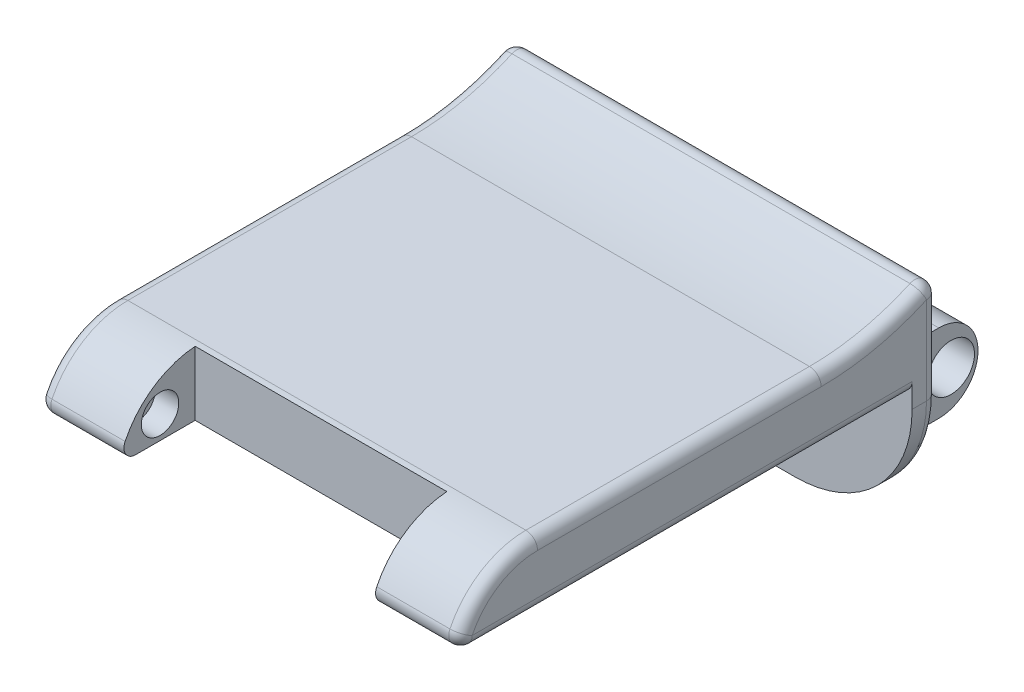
from build123d import *

# Parameters (mm, degrees)
BOSS_EXTRUDE1_DEPTH     = 18
SKETCH2_W               = 21.5
SKETCH2_H               = 6.5
CUT_EXTRUDE1_DEPTH      = 36
FILLET1_R               = 1
FILLET2_R               = 10
CUT_EXTRUDE2_DEPTH      = 23
CUT_EXTRUDE2_DEPTH_BACK = 2
SKETCH3_R               = 1.6
SKETCH4_W               = 11.8
SKETCH4_H               = 6.7
BOSS_EXTRUDE2_DEPTH     = 5.6
CUT_EXTRUDE3_DEPTH      = 47.916133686
SKETCH6_R               = 2
CUT_EXTRUDE4_DEPTH      = 47.916133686
SKETCH7_W               = 33.22
SKETCH7_H               = 24.2
CUT_EXTRUDE5_DEPTH      = 1
M1_6_TAPPED_HOLE1_D     = 1.25
M1_6_TAPPED_HOLE1_DEPTH = 3
M1_6_TAPPED_HOLE1_TIP   = 0.375537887
FILLET3_R               = 1
FILLET4_R               = 1


with BuildPart() as part:
    # Sketch1 → Boss-Extrude1 (new, symmetric)
    with BuildSketch(Plane(origin=(0, 0, 0), x_dir=(0, 0, -1), z_dir=(1, 0, 0))):
        with BuildLine():
            Line((-16.23, 0), (22.77, 0))
            Line((22.77, 0), (22.77, -11.06))
            Line((22.77, -11.06), (25, -11.06))
            Line((25, -11.06), (25, 8.04))
            ThreePointArc((25, 8.04), (20.158769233, 6.144924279), (15, 5.5))
            Line((15, 5.5), (-9.23, 5.5))
            ThreePointArc((-9.23, 5.5), (-13.681123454, 3.960520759), (-16.23, 0))
        make_face()
    extrude(amount=BOSS_EXTRUDE1_DEPTH, both=True)

    # Sketch2 → Cut-Extrude1 (cut)
    with BuildSketch(Plane(origin=(0, 5.5, 0), x_dir=(1, 0, 0), z_dir=(0, 1, 0))):
        with Locations((0, -12.98)):
            Rectangle(SKETCH2_W, SKETCH2_H)
    extrude(amount=-CUT_EXTRUDE1_DEPTH, mode=Mode.SUBTRACT)

    # Fillet1
    fillet1_edges = [part.edges().sort_by_distance(p)[0] for p in [
        (0, 8.04, -25),
    ]]
    fillet(fillet1_edges, radius=FILLET1_R)

    # Fillet2
    fillet2_edges = [part.edges().sort_by_distance(p)[0] for p in [
        (18, -11.06, -23.885),
        (-18, -11.06, -23.885),
    ]]
    fillet(fillet2_edges, radius=FILLET2_R)

    # Sketch3 → Cut-Extrude2 (cut, two sides: drawn at the far end of the back side and taken through both)
    with BuildSketch(Plane(origin=(-10.75, 0, 0), x_dir=(0, 0, -1), z_dir=(1, 0, 0)).offset(-CUT_EXTRUDE2_DEPTH_BACK)):
        with Locations((-12.73, 1.9826289)):
            Circle(SKETCH3_R)
    extrude(amount=CUT_EXTRUDE2_DEPTH + CUT_EXTRUDE2_DEPTH_BACK, mode=Mode.SUBTRACT)

    # Sketch4 → Boss-Extrude2 (add)
    with BuildSketch(Plane(origin=(0, 0, -25), x_dir=(-1, 0, 0), z_dir=(0, 0, -1))):
        with Locations((-9.9, -1.720538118)):
            Rectangle(SKETCH4_W, SKETCH4_H)
        with Locations((9.9, -1.720538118)):
            Rectangle(SKETCH4_W, SKETCH4_H)
    extrude(amount=BOSS_EXTRUDE2_DEPTH)

    # Sketch5 → Cut-Extrude3 (cut, through all)
    with BuildSketch(Plane(origin=(15.8, 0, 0), x_dir=(0, 0, -1), z_dir=(1, 0, 0))):
        with BuildLine():
            Line((30.6, -1.720538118), (30.6, 1.629461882))
            Line((30.6, 1.629461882), (27.25, 1.629461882))
            ThreePointArc((27.25, 1.629461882), (29.618807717, 0.648269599), (30.6, -1.720538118))
        make_face()
        with BuildLine():
            Line((30.6, -5.070538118), (30.6, -1.720538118))
            ThreePointArc((30.6, -1.720538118), (29.618807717, -4.089345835), (27.25, -5.070538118))
            Line((27.25, -5.070538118), (30.6, -5.070538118))
        make_face()
    extrude(amount=-CUT_EXTRUDE3_DEPTH, mode=Mode.SUBTRACT)

    # Sketch6 → Cut-Extrude4 (cut, through all)
    with BuildSketch(Plane(origin=(15.8, 0, 0), x_dir=(0, 0, -1), z_dir=(1, 0, 0))):
        with Locations((28.302174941, -1.820538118)):
            Circle(SKETCH6_R)
    extrude(amount=-CUT_EXTRUDE4_DEPTH, mode=Mode.SUBTRACT)

    # Sketch7 → Cut-Extrude5 (cut)
    with BuildSketch(Plane.XZ):
        with Locations((0, -3.47)):
            Rectangle(SKETCH7_W, SKETCH7_H)
    extrude(amount=-CUT_EXTRUDE5_DEPTH, mode=Mode.SUBTRACT)

    # M1.6 Tapped Hole1
    with Locations(Plane(origin=(0, 1, 0), x_dir=(-1, 0, 0), z_dir=(0, -1, 0))):
        with Locations((9.7, 5.27), (-9.7, 5.27)):
            Hole(M1_6_TAPPED_HOLE1_D / 2, depth=M1_6_TAPPED_HOLE1_DEPTH)
            with Locations((0, 0, -(M1_6_TAPPED_HOLE1_DEPTH + M1_6_TAPPED_HOLE1_TIP / 2))):  # 118° drill point
                Cone(0, M1_6_TAPPED_HOLE1_D / 2, M1_6_TAPPED_HOLE1_TIP, mode=Mode.SUBTRACT)

    # Fillet3
    fillet3_edges = [part.edges().sort_by_distance(p)[0] for p in [
        (14.375, 0, 16.23),
        (-14.375, 0, 16.23),
    ]]
    fillet(fillet3_edges, radius=FILLET3_R)

    # Fillet4
    fillet4_edges = [part.edges().sort_by_distance(p)[0] for p in [
        (-18, 0, -3.977965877),
        (18, 0, -3.977965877),
        (-18, 0.468914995, 15.661386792),
        (18, 0.468914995, 15.661386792),
        (18, 5.5, -2.885),
        (18, 4.399999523, 13.056226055),
        (-18, 5.96556671, -19.392628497),
        (18, 5.96556671, -19.392628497),
        (-18, 7.269083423, -24.543171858),
        (18, 7.269083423, -24.543171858),
        (0, -11.06, -25),
        (-18, 2.684730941, -25),
        (18, 2.684730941, -25),
        (15.071067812, -8.131067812, -25),
        (-15.071067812, -8.131067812, -25),
        (-18, 5.5, -2.885),
        (-18, 4.399999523, 13.056226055),
    ]]
    fillet(fillet4_edges, radius=FILLET4_R)


solid = part.part
